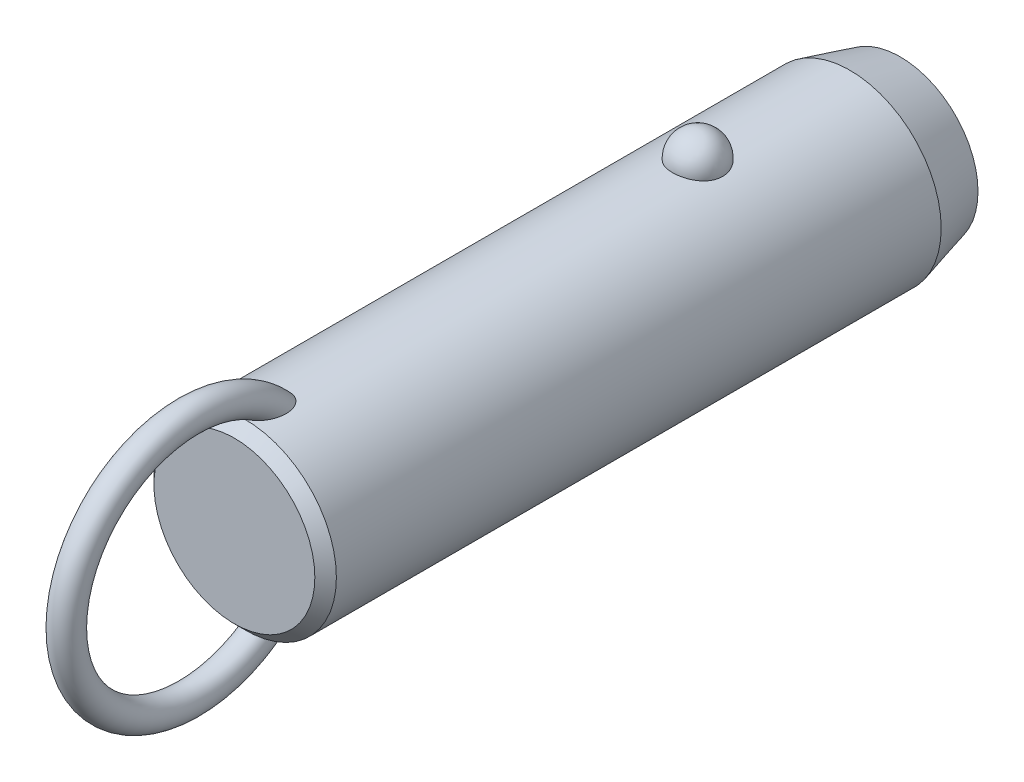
ISO-10303-21;
HEADER;
FILE_DESCRIPTION(('STEP AP214'),'2;1');
FILE_NAME('part.step','',(''),(''),'','','');
FILE_SCHEMA(('AUTOMOTIVE_DESIGN { 1 0 10303 214 1 1 1 1 }'));
ENDSEC;
DATA;
#1=APPLICATION_CONTEXT('core data for automotive mechanical design processes');
#2=APPLICATION_PROTOCOL_DEFINITION('international standard','automotive_design',2000,#1);
#3=PRODUCT_CONTEXT('',#1,'mechanical');
#4=PRODUCT('Part','Part','',(#3));
#5=PRODUCT_RELATED_PRODUCT_CATEGORY('part','',(#4));
#6=PRODUCT_DEFINITION_FORMATION('','',#4);
#7=PRODUCT_DEFINITION_CONTEXT('part definition',#1,'design');
#8=PRODUCT_DEFINITION('design','',#6,#7);
#9=PRODUCT_DEFINITION_SHAPE('','',#8);
#10=(LENGTH_UNIT() NAMED_UNIT(*) SI_UNIT(.MILLI.,.METRE.));
#11=(NAMED_UNIT(*) PLANE_ANGLE_UNIT() SI_UNIT($,.RADIAN.));
#12=(NAMED_UNIT(*) SI_UNIT($,.STERADIAN.) SOLID_ANGLE_UNIT());
#13=UNCERTAINTY_MEASURE_WITH_UNIT(LENGTH_MEASURE(1.E-05),#10,'distance_accuracy_value','');
#14=(GEOMETRIC_REPRESENTATION_CONTEXT(3) GLOBAL_UNCERTAINTY_ASSIGNED_CONTEXT((#13)) GLOBAL_UNIT_ASSIGNED_CONTEXT((#10,
#11,#12)) REPRESENTATION_CONTEXT('',''));
#15=CARTESIAN_POINT('',(0.,0.,0.));
#16=DIRECTION('',(0.,0.,1.));
#17=DIRECTION('',(1.,0.,0.));
#18=AXIS2_PLACEMENT_3D('',#15,#16,#17);
#19=CARTESIAN_POINT('',(0.,0.,48.3));
#20=DIRECTION('',(0.,0.,-1.));
#21=DIRECTION('',(-1.,0.,0.));
#22=AXIS2_PLACEMENT_3D('',#19,#20,#21);
#23=CYLINDRICAL_SURFACE('',#22,12.7);
#24=CARTESIAN_POINT('',(3.46661256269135,12.2177165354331,-3.5));
#25=CARTESIAN_POINT('',(3.4666090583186,12.2177194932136,-3.30432790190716));
#26=CARTESIAN_POINT('',(3.45063567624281,12.2222841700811,-3.10861112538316));
#27=CARTESIAN_POINT('',(3.38712451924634,12.2400345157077,-2.72271899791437));
#28=CARTESIAN_POINT('',(3.33957415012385,12.2532236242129,-2.53254588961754));
#29=CARTESIAN_POINT('',(3.2141234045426,12.286724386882,-2.16324948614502));
#30=CARTESIAN_POINT('',(3.13623639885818,12.3070329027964,-1.98412136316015));
#31=CARTESIAN_POINT('',(2.95205930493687,12.3525018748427,-1.64180592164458));
#32=CARTESIAN_POINT('',(2.84577003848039,12.3776621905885,-1.47861814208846));
#33=CARTESIAN_POINT('',(2.60688050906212,12.4301712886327,-1.17190583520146));
#34=CARTESIAN_POINT('',(2.47415697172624,12.4575299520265,-1.02847897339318));
#35=CARTESIAN_POINT('',(2.18615174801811,12.5112810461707,-0.766177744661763));
#36=CARTESIAN_POINT('',(2.03087002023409,12.5376734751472,-0.647303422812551));
#37=CARTESIAN_POINT('',(1.70237334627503,12.5864761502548,-0.437732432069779));
#38=CARTESIAN_POINT('',(1.52920948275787,12.6088972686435,-0.346958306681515));
#39=CARTESIAN_POINT('',(1.16944170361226,12.6473352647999,-0.195750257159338));
#40=CARTESIAN_POINT('',(0.982839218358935,12.663352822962,-0.135313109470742));
#41=CARTESIAN_POINT('',(0.604961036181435,12.6869706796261,-0.0473241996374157));
#42=CARTESIAN_POINT('',(0.413823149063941,12.6947125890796,-0.0192185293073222));
#43=CARTESIAN_POINT('',(0.0293827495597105,12.7014203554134,0.00517254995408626));
#44=CARTESIAN_POINT('',(-0.163919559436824,12.7003870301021,0.00146092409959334));
#45=CARTESIAN_POINT('',(-0.544374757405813,12.689735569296,-0.0373939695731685));
#46=CARTESIAN_POINT('',(-0.731575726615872,12.6802364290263,-0.0721015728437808));
#47=CARTESIAN_POINT('',(-1.09733277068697,12.6538333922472,-0.171364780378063));
#48=CARTESIAN_POINT('',(-1.27588869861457,12.6369293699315,-0.235920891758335));
#49=CARTESIAN_POINT('',(-1.6204698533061,12.5973946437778,-0.393548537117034));
#50=CARTESIAN_POINT('',(-1.78641865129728,12.5747321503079,-0.486778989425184));
#51=CARTESIAN_POINT('',(-2.10030671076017,12.5261316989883,-0.699110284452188));
#52=CARTESIAN_POINT('',(-2.24824419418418,12.5001934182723,-0.818213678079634));
#53=CARTESIAN_POINT('',(-2.52491489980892,12.4472906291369,-1.08157124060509));
#54=CARTESIAN_POINT('',(-2.65324222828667,12.4203160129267,-1.22624992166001));
#55=CARTESIAN_POINT('',(-2.88410007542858,12.3687509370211,-1.53528325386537));
#56=CARTESIAN_POINT('',(-2.98662883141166,12.3441606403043,-1.69963924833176));
#57=CARTESIAN_POINT('',(-3.16432417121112,12.2998199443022,-2.04548497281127));
#58=CARTESIAN_POINT('',(-3.23917525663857,12.2801261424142,-2.22714424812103));
#59=CARTESIAN_POINT('',(-3.35800573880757,12.248167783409,-2.6009138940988));
#60=CARTESIAN_POINT('',(-3.4019860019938,12.2359030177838,-2.79302397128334));
#61=CARTESIAN_POINT('',(-3.45784812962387,12.2202347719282,-3.18140279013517));
#62=CARTESIAN_POINT('',(-3.46986123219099,12.2167950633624,-3.37765118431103));
#63=CARTESIAN_POINT('',(-3.46186273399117,12.2190638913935,-3.76943689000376));
#64=CARTESIAN_POINT('',(-3.44185196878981,12.2247721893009,-3.96497421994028));
#65=CARTESIAN_POINT('',(-3.37048652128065,12.2446381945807,-4.34881728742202));
#66=CARTESIAN_POINT('',(-3.31928253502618,12.2587552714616,-4.53715319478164));
#67=CARTESIAN_POINT('',(-3.18693461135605,12.2938237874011,-4.90231727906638));
#68=CARTESIAN_POINT('',(-3.1057895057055,12.3147754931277,-5.07914500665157));
#69=CARTESIAN_POINT('',(-2.91506431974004,12.3613125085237,-5.41732059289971));
#70=CARTESIAN_POINT('',(-2.80533587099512,12.3869217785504,-5.57858147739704));
#71=CARTESIAN_POINT('',(-2.560414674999,12.4398525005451,-5.88013283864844));
#72=CARTESIAN_POINT('',(-2.42522099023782,12.4671740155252,-6.02042254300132));
#73=CARTESIAN_POINT('',(-2.1323357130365,12.5205965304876,-6.27662798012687));
#74=CARTESIAN_POINT('',(-1.97456596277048,12.5466928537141,-6.3924554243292));
#75=CARTESIAN_POINT('',(-1.64115839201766,12.5946384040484,-6.59583547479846));
#76=CARTESIAN_POINT('',(-1.46552179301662,12.6164879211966,-6.68339001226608));
#77=CARTESIAN_POINT('',(-1.10356050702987,12.6532533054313,-6.82682153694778));
#78=CARTESIAN_POINT('',(-0.917391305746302,12.6682500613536,-6.8830698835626));
#79=CARTESIAN_POINT('',(-0.537836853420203,12.6900288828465,-6.96386887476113));
#80=CARTESIAN_POINT('',(-0.344452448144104,12.6968119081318,-6.9884232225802));
#81=CARTESIAN_POINT('',(0.0402577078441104,12.7013667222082,-7.00496469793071));
#82=CARTESIAN_POINT('',(0.231556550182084,12.6993008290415,-6.99753844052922));
#83=CARTESIAN_POINT('',(0.610105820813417,12.6867505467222,-6.9516636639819));
#84=CARTESIAN_POINT('',(0.797356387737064,12.6762664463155,-6.913216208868));
#85=CARTESIAN_POINT('',(1.16186657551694,12.6480587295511,-6.80658431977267));
#86=CARTESIAN_POINT('',(1.33915951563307,12.6303611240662,-6.73850666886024));
#87=CARTESIAN_POINT('',(1.67968518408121,12.5896027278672,-6.5745087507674));
#88=CARTESIAN_POINT('',(1.84291705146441,12.5665416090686,-6.47858678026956));
#89=CARTESIAN_POINT('',(2.15340192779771,12.5171072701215,-6.25982455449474));
#90=CARTESIAN_POINT('',(2.30037831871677,12.4906895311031,-6.13660186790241));
#91=CARTESIAN_POINT('',(2.5717412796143,12.4376567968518,-5.86739587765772));
#92=CARTESIAN_POINT('',(2.69612388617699,12.4110417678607,-5.72140858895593));
#93=CARTESIAN_POINT('',(2.92107785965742,12.360051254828,-5.40794137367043));
#94=CARTESIAN_POINT('',(3.02121329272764,12.3357209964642,-5.24014110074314));
#95=CARTESIAN_POINT('',(3.19236291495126,12.2925446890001,-4.8896986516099));
#96=CARTESIAN_POINT('',(3.26338839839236,12.2736965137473,-4.70706226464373));
#97=CARTESIAN_POINT('',(3.36788038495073,12.245404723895,-4.35469510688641));
#98=CARTESIAN_POINT('',(3.40484026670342,12.2351018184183,-4.18605935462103));
#99=CARTESIAN_POINT('',(3.45420764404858,12.2212564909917,-3.84496058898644));
#100=CARTESIAN_POINT('',(3.46661565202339,12.2177139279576,-3.67249765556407));
#101=CARTESIAN_POINT('',(3.46661256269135,12.2177165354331,-3.5));
#102=B_SPLINE_CURVE_WITH_KNOTS('',3,(#24,#25,#26,#27,#28,#29,#30,#31,#32,#33,#34,#35,#36,#37,
#38,#39,#40,#41,#42,#43,#44,#45,#46,#47,#48,#49,#50,#51,#52,#53,#54,#55,#56,#57,#58,#59,#60,#61,
#62,#63,#64,#65,#66,#67,#68,#69,#70,#71,#72,#73,#74,#75,#76,#77,#78,#79,#80,#81,#82,#83,#84,#85,
#86,#87,#88,#89,#90,#91,#92,#93,#94,#95,#96,#97,#98,#99,#100,#101),.UNSPECIFIED.,.T.,.F.,(4,2,2,
2,2,2,2,2,2,2,2,2,2,2,2,2,2,2,2,2,2,2,2,2,2,2,2,2,2,2,2,2,2,2,2,2,2,2,4),(0.,0.586396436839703,
1.17302689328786,1.7593990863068,2.34575431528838,2.93491084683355,3.52406845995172,
4.11158733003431,4.69904375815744,5.2762784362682,5.85345931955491,6.42265312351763,
6.99185659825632,7.56427334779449,8.136746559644,8.71981013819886,9.3029135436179,
9.89247258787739,10.4820150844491,11.0691335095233,11.6562366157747,12.2405256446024,
12.8248374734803,13.412244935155,13.9996740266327,14.5891883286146,15.1786623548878,
15.7609861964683,16.3432419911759,16.914863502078,17.4864654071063,18.0560241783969,
18.6256177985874,19.2037609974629,19.7820055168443,20.3699810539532,20.9577282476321,
21.4746855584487,21.9916320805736),.UNSPECIFIED.);
#103=CARTESIAN_POINT('',(3.46661256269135,12.2177165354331,-3.5));
#104=VERTEX_POINT('',#103);
#105=EDGE_CURVE('E41',#104,#104,#102,.T.);
#106=ORIENTED_EDGE('',*,*,#105,.T.);
#107=EDGE_LOOP('',(#106));
#108=FACE_BOUND('',#107,.T.);
#109=CARTESIAN_POINT('',(0.,0.,59.5));
#110=DIRECTION('',(0.,0.,1.));
#111=DIRECTION('',(1.,0.,0.));
#112=AXIS2_PLACEMENT_3D('',#109,#110,#111);
#113=CIRCLE('',#112,12.7);
#114=CARTESIAN_POINT('',(12.7,0.,59.5));
#115=VERTEX_POINT('',#114);
#116=EDGE_CURVE('E10',#115,#115,#113,.F.);
#117=ORIENTED_EDGE('',*,*,#116,.T.);
#118=EDGE_LOOP('',(#117));
#119=FACE_BOUND('',#118,.T.);
#120=CARTESIAN_POINT('',(-0.548122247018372,-12.6881662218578,53.2432187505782));
#121=CARTESIAN_POINT('',(-0.648865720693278,-12.6838128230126,53.277926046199));
#122=CARTESIAN_POINT('',(-0.746398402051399,-12.6783867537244,53.3220428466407));
#123=CARTESIAN_POINT('',(-0.932125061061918,-12.666091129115,53.4267647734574));
#124=CARTESIAN_POINT('',(-1.02030388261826,-12.6592192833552,53.487396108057));
#125=CARTESIAN_POINT('',(-1.18487740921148,-12.6448747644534,53.621847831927));
#126=CARTESIAN_POINT('',(-1.26134296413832,-12.637406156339,53.6955825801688));
#127=CARTESIAN_POINT('',(-1.4023120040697,-12.6225412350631,53.8536045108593));
#128=CARTESIAN_POINT('',(-1.46681470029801,-12.6151449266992,53.9378923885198));
#129=CARTESIAN_POINT('',(-1.60714786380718,-12.5981718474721,54.1496577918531));
#130=CARTESIAN_POINT('',(-1.67725126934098,-12.588900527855,54.2809624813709));
#131=CARTESIAN_POINT('',(-1.79536591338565,-12.5725964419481,54.5532471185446));
#132=CARTESIAN_POINT('',(-1.84333535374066,-12.5655679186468,54.6942447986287));
#133=CARTESIAN_POINT('',(-1.93422576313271,-12.5519624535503,55.0376455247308));
#134=CARTESIAN_POINT('',(-1.96788773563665,-12.5466298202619,55.2425578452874));
#135=CARTESIAN_POINT('',(-1.9941399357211,-12.542463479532,55.5517600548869));
#136=CARTESIAN_POINT('',(-1.99883864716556,-12.5417153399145,55.6552987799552));
#137=CARTESIAN_POINT('',(-2.00078003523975,-12.5414074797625,55.8624512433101));
#138=CARTESIAN_POINT('',(-1.99802449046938,-12.5418474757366,55.9660649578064));
#139=CARTESIAN_POINT('',(-1.98336733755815,-12.5441750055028,56.2103207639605));
#140=CARTESIAN_POINT('',(-1.96851430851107,-12.5465291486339,56.3507804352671));
#141=CARTESIAN_POINT('',(-1.92707089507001,-12.5529612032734,56.6299607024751));
#142=CARTESIAN_POINT('',(-1.90047458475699,-12.5570399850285,56.7686803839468));
#143=CARTESIAN_POINT('',(-1.83619120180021,-12.5666008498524,57.0434113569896));
#144=CARTESIAN_POINT('',(-1.79850828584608,-12.57208240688,57.1794236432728));
#145=CARTESIAN_POINT('',(-1.71223796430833,-12.5841228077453,57.4478421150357));
#146=CARTESIAN_POINT('',(-1.66365679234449,-12.5906810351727,57.5802503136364));
#147=CARTESIAN_POINT('',(-1.57804503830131,-12.6016176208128,57.7854887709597));
#148=CARTESIAN_POINT('',(-1.54477252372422,-12.6057501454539,57.8599149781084));
#149=CARTESIAN_POINT('',(-1.47424480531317,-12.6141930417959,58.0068393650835));
#150=CARTESIAN_POINT('',(-1.43699041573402,-12.6185033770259,58.0793379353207));
#151=CARTESIAN_POINT('',(-1.35825795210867,-12.6272207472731,58.2218926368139));
#152=CARTESIAN_POINT('',(-1.31678520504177,-12.6316276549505,58.2919517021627));
#153=CARTESIAN_POINT('',(-1.22917793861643,-12.6404532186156,58.4290705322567));
#154=CARTESIAN_POINT('',(-1.18304514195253,-12.6448718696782,58.4961313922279));
#155=CARTESIAN_POINT('',(-1.0724641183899,-12.6547893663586,58.6438741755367));
#156=CARTESIAN_POINT('',(-1.00642239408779,-12.6602600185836,58.7233844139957));
#157=CARTESIAN_POINT('',(-0.86444142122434,-12.6707460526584,58.8731698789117));
#158=CARTESIAN_POINT('',(-0.788516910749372,-12.6757620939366,58.9434585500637));
#159=CARTESIAN_POINT('',(-0.652215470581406,-12.6833591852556,59.0486801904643));
#160=CARTESIAN_POINT('',(-0.594982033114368,-12.6861973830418,59.0876241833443));
#161=CARTESIAN_POINT('',(-0.475269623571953,-12.6912445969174,59.1564899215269));
#162=CARTESIAN_POINT('',(-0.412800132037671,-12.6934547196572,59.1864275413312));
#163=CARTESIAN_POINT('',(-0.29574972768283,-12.6966636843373,59.2297565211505));
#164=CARTESIAN_POINT('',(-0.241949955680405,-12.6978134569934,59.2452188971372));
#165=CARTESIAN_POINT('',(-0.132508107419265,-12.6994261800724,59.2668845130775));
#166=CARTESIAN_POINT('',(-0.0768679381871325,-12.6998898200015,59.2730970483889));
#167=CARTESIAN_POINT('',(0.0347696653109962,-12.7000752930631,59.2755838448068));
#168=CARTESIAN_POINT('',(0.0907676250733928,-12.6997954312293,59.2718353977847));
#169=CARTESIAN_POINT('',(0.201283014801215,-12.6985255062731,59.2547883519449));
#170=CARTESIAN_POINT('',(0.255799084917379,-12.6975348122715,59.2414812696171));
#171=CARTESIAN_POINT('',(0.376042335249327,-12.6946091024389,59.2020379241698));
#172=CARTESIAN_POINT('',(0.440950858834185,-12.6924943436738,59.1734492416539));
#173=CARTESIAN_POINT('',(0.565350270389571,-12.6875639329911,59.1063234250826));
#174=CARTESIAN_POINT('',(0.624828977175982,-12.6847467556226,59.0677646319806));
#175=CARTESIAN_POINT('',(0.774116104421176,-12.6767252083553,58.956949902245));
#176=CARTESIAN_POINT('',(0.859449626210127,-12.6711344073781,58.8787605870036));
#177=CARTESIAN_POINT('',(1.01789440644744,-12.6593922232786,58.710943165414));
#178=CARTESIAN_POINT('',(1.09096902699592,-12.653239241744,58.621282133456));
#179=CARTESIAN_POINT('',(1.22268793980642,-12.6411674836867,58.4402658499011));
#180=CARTESIAN_POINT('',(1.28193986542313,-12.6352572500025,58.349345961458));
#181=CARTESIAN_POINT('',(1.39259777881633,-12.6235401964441,58.1627929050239));
#182=CARTESIAN_POINT('',(1.44399707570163,-12.6177334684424,58.0671558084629));
#183=CARTESIAN_POINT('',(1.53972870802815,-12.6064093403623,57.8722738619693));
#184=CARTESIAN_POINT('',(1.58405262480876,-12.6008922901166,57.7730248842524));
#185=CARTESIAN_POINT('',(1.66600705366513,-12.5903187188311,57.5717727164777));
#186=CARTESIAN_POINT('',(1.70363651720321,-12.5852622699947,57.4697690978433));
#187=CARTESIAN_POINT('',(1.77545379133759,-12.5753406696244,57.2543580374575));
#188=CARTESIAN_POINT('',(1.80903453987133,-12.5705328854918,57.140745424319));
#189=CARTESIAN_POINT('',(1.86844163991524,-12.5618400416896,56.9114575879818));
#190=CARTESIAN_POINT('',(1.89426665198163,-12.5579551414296,56.7957820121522));
#191=CARTESIAN_POINT('',(1.9378546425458,-12.5513030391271,56.5630072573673));
#192=CARTESIAN_POINT('',(1.9556264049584,-12.5485346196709,56.4459097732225));
#193=CARTESIAN_POINT('',(1.98264463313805,-12.5442934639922,56.2107473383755));
#194=CARTESIAN_POINT('',(1.99189298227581,-12.5428204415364,56.0926826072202));
#195=CARTESIAN_POINT('',(2.00416068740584,-12.540871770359,55.7806225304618));
#196=CARTESIAN_POINT('',(1.99944433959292,-12.541631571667,55.5862290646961));
#197=CARTESIAN_POINT('',(1.96113755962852,-12.5476846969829,55.2003095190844));
#198=CARTESIAN_POINT('',(1.92758341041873,-12.5529723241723,55.0087801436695));
#199=CARTESIAN_POINT('',(1.8393434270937,-12.5661532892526,54.6822728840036));
#200=CARTESIAN_POINT('',(1.79215440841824,-12.5730485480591,54.5452499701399));
#201=CARTESIAN_POINT('',(1.67676242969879,-12.588958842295,54.2804459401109));
#202=CARTESIAN_POINT('',(1.60859050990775,-12.597970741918,54.1526515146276));
#203=CARTESIAN_POINT('',(1.46583832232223,-12.6152829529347,53.9358006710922));
#204=CARTESIAN_POINT('',(1.39525727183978,-12.6233659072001,53.8441050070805));
#205=CARTESIAN_POINT('',(1.23992594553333,-12.6395676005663,53.6734854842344));
#206=CARTESIAN_POINT('',(1.15517932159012,-12.6476863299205,53.5945583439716));
#207=CARTESIAN_POINT('',(0.971995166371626,-12.6630846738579,53.4526438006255));
#208=CARTESIAN_POINT('',(0.873456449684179,-12.6703572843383,53.3897849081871));
#209=CARTESIAN_POINT('',(0.665847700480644,-12.6829569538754,53.2844870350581));
#210=CARTESIAN_POINT('',(0.556784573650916,-12.688285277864,53.2420347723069));
#211=CARTESIAN_POINT('',(0.347338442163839,-12.6956226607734,53.1844434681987));
#212=CARTESIAN_POINT('',(0.247759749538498,-12.6979816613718,53.1663996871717));
#213=CARTESIAN_POINT('',(0.0470218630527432,-12.7003077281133,53.1486007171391));
#214=CARTESIAN_POINT('',(-0.0541350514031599,-12.7002779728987,53.1488212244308));
#215=CARTESIAN_POINT('',(-0.221414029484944,-12.6982482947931,53.1643639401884));
#216=CARTESIAN_POINT('',(-0.288055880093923,-12.6969033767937,53.1746662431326));
#217=CARTESIAN_POINT('',(-0.419599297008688,-12.6932369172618,53.2031348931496));
#218=CARTESIAN_POINT('',(-0.484501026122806,-12.6909154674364,53.2213005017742));
#219=CARTESIAN_POINT('',(-0.548122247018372,-12.6881662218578,53.2432187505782));
#220=B_SPLINE_CURVE_WITH_KNOTS('',3,(#120,#121,#122,#123,#124,#125,#126,#127,#128,#129,#130,
#131,#132,#133,#134,#135,#136,#137,#138,#139,#140,#141,#142,#143,#144,#145,#146,#147,#148,#149,
#150,#151,#152,#153,#154,#155,#156,#157,#158,#159,#160,#161,#162,#163,#164,#165,#166,#167,#168,
#169,#170,#171,#172,#173,#174,#175,#176,#177,#178,#179,#180,#181,#182,#183,#184,#185,#186,#187,
#188,#189,#190,#191,#192,#193,#194,#195,#196,#197,#198,#199,#200,#201,#202,#203,#204,#205,#206,
#207,#208,#209,#210,#211,#212,#213,#214,#215,#216,#217,#218,#219),.UNSPECIFIED.,.T.,.F.,(4,2,2,
2,2,2,2,2,2,2,2,2,2,2,2,2,2,2,2,2,2,2,2,2,2,2,2,2,2,2,2,2,2,2,2,2,2,2,2,2,2,2,2,2,2,2,2,2,2,4),
(0.,0.319642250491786,0.63979475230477,0.957927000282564,1.27608021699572,1.72100165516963,
2.16675988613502,2.78630021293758,3.09705782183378,3.40774128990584,3.83096358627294,
4.25439969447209,4.67767724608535,5.10071330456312,5.34550297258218,5.59024267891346,
5.83467707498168,6.07902143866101,6.38891080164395,6.69834321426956,6.90560910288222,
7.11250749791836,7.27977315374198,7.44687060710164,7.61434932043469,7.78197685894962,
7.99365544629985,8.20579780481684,8.55147335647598,8.8981642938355,9.22375138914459,
9.54961437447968,9.8758622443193,10.202161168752,10.557587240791,10.9130746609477,
11.2681734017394,11.6231936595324,12.2046601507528,12.7853961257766,13.219164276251,
13.6522938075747,13.9989174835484,14.3454519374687,14.6946768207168,15.0436740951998,
15.3457513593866,15.6474266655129,15.8493051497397,16.0511646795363),.UNSPECIFIED.);
#221=CARTESIAN_POINT('',(-0.548122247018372,-12.6881662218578,53.2432187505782));
#222=VERTEX_POINT('',#221);
#223=EDGE_CURVE('E59',#222,#222,#220,.T.);
#224=ORIENTED_EDGE('',*,*,#223,.T.);
#225=EDGE_LOOP('',(#224));
#226=FACE_BOUND('',#225,.T.);
#227=CARTESIAN_POINT('',(-0.548122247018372,12.6881662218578,53.2432187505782));
#228=CARTESIAN_POINT('',(-0.459436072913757,12.6919968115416,53.212673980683));
#229=CARTESIAN_POINT('',(-0.368189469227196,12.6949996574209,53.1893913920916));
#230=CARTESIAN_POINT('',(-0.183024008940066,12.6990186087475,53.1584062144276));
#231=CARTESIAN_POINT('',(-0.089104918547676,12.7000345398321,53.1507049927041));
#232=CARTESIAN_POINT('',(0.0987147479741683,12.6999636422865,53.1512455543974));
#233=CARTESIAN_POINT('',(0.192615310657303,12.6988761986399,53.1594920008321));
#234=CARTESIAN_POINT('',(0.377658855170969,12.6947211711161,53.1915515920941));
#235=CARTESIAN_POINT('',(0.46880177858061,12.6916535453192,53.2153650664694));
#236=CARTESIAN_POINT('',(0.645809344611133,12.6838788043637,53.2774565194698));
#237=CARTESIAN_POINT('',(0.731679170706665,12.6791733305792,53.315720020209));
#238=CARTESIAN_POINT('',(0.896315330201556,12.6686004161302,53.405120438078));
#239=CARTESIAN_POINT('',(0.975080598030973,12.6627328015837,53.4562592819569));
#240=CARTESIAN_POINT('',(1.12963655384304,12.6499161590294,53.5736782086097));
#241=CARTESIAN_POINT('',(1.20478673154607,12.6429194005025,53.6407929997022));
#242=CARTESIAN_POINT('',(1.34448241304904,12.6288282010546,53.7852250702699));
#243=CARTESIAN_POINT('',(1.40902173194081,12.621733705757,53.8625482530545));
#244=CARTESIAN_POINT('',(1.55208211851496,12.6050877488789,54.0592475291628));
#245=CARTESIAN_POINT('',(1.62510490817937,12.5957546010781,54.1826540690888));
#246=CARTESIAN_POINT('',(1.7501904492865,12.5789823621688,54.4397690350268));
#247=CARTESIAN_POINT('',(1.80221377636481,12.5715468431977,54.573496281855));
#248=CARTESIAN_POINT('',(1.90309965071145,12.5567434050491,54.8983516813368));
#249=CARTESIAN_POINT('',(1.94342317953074,12.5504515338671,55.0921611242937));
#250=CARTESIAN_POINT('',(1.99332997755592,12.5426147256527,55.4837881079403));
#251=CARTESIAN_POINT('',(2.00285305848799,12.5410790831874,55.681612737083));
#252=CARTESIAN_POINT('',(1.99678999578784,12.5420407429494,56.0166427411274));
#253=CARTESIAN_POINT('',(1.98794117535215,12.5434564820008,56.1540428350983));
#254=CARTESIAN_POINT('',(1.95865119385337,12.5480641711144,56.4276394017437));
#255=CARTESIAN_POINT('',(1.93820436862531,12.5512569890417,56.5638352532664));
#256=CARTESIAN_POINT('',(1.88647896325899,12.5591352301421,56.8342493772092));
#257=CARTESIAN_POINT('',(1.85518800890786,12.5638223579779,56.9684652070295));
#258=CARTESIAN_POINT('',(1.78217886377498,12.5743868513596,57.2339362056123));
#259=CARTESIAN_POINT('',(1.74046509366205,12.5802637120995,57.3651926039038));
#260=CARTESIAN_POINT('',(1.66024095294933,12.5910571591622,57.5860855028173));
#261=CARTESIAN_POINT('',(1.62434772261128,12.5957535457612,57.6766904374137));
#262=CARTESIAN_POINT('',(1.54709009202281,12.6054762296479,57.8555125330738));
#263=CARTESIAN_POINT('',(1.50572681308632,12.6105024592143,57.9437301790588));
#264=CARTESIAN_POINT('',(1.41728020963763,12.620748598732,58.1169321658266));
#265=CARTESIAN_POINT('',(1.37021377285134,12.625967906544,58.2019251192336));
#266=CARTESIAN_POINT('',(1.26969620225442,12.6364721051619,58.3680072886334));
#267=CARTESIAN_POINT('',(1.21624929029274,12.6417569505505,58.4490990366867));
#268=CARTESIAN_POINT('',(1.10304413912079,12.6521331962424,58.6047027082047));
#269=CARTESIAN_POINT('',(1.04340936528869,12.657226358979,58.6793033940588));
#270=CARTESIAN_POINT('',(0.915919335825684,12.6670906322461,58.821324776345));
#271=CARTESIAN_POINT('',(0.848064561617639,12.6718617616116,58.8887458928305));
#272=CARTESIAN_POINT('',(0.717035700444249,12.67987711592,59.0006247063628));
#273=CARTESIAN_POINT('',(0.655526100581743,12.6832377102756,59.0469970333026));
#274=CARTESIAN_POINT('',(0.525985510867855,12.6892676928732,59.1296195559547));
#275=CARTESIAN_POINT('',(0.457969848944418,12.6919386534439,59.1658927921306));
#276=CARTESIAN_POINT('',(0.334859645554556,12.695691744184,59.2166572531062));
#277=CARTESIAN_POINT('',(0.281116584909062,12.6970073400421,59.2343733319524));
#278=CARTESIAN_POINT('',(0.171425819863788,12.6989609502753,59.2606429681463));
#279=CARTESIAN_POINT('',(0.115480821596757,12.699599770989,59.2692074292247));
#280=CARTESIAN_POINT('',(0.00272618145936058,12.7001251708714,59.2762531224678));
#281=CARTESIAN_POINT('',(-0.0540859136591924,12.7000089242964,59.2746964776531));
#282=CARTESIAN_POINT('',(-0.166544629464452,12.6990328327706,59.2616005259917));
#283=CARTESIAN_POINT('',(-0.222190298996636,12.6981724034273,59.2500533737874));
#284=CARTESIAN_POINT('',(-0.342018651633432,12.695562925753,59.2149128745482));
#285=CARTESIAN_POINT('',(-0.405606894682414,12.6936676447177,59.1893322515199));
#286=CARTESIAN_POINT('',(-0.527815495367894,12.6891754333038,59.1283111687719));
#287=CARTESIAN_POINT('',(-0.586425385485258,12.6865770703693,59.0928505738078));
#288=CARTESIAN_POINT('',(-0.731842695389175,12.6792129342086,58.9914960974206));
#289=CARTESIAN_POINT('',(-0.814709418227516,12.6740767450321,58.9200395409));
#290=CARTESIAN_POINT('',(-0.969101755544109,12.6632083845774,58.7658900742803));
#291=CARTESIAN_POINT('',(-1.04059564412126,12.6574746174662,58.6831668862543));
#292=CARTESIAN_POINT('',(-1.1698111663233,12.6461638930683,58.5158096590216));
#293=CARTESIAN_POINT('',(-1.22811369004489,12.6405994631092,58.4316166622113));
#294=CARTESIAN_POINT('',(-1.33743405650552,12.6295007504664,58.2585791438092));
#295=CARTESIAN_POINT('',(-1.38844577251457,12.6239664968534,58.1697307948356));
#296=CARTESIAN_POINT('',(-1.48400702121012,12.6130898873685,57.988389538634));
#297=CARTESIAN_POINT('',(-1.52854232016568,12.6077479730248,57.8958891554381));
#298=CARTESIAN_POINT('',(-1.61150113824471,12.5974127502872,57.7081607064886));
#299=CARTESIAN_POINT('',(-1.64992317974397,12.5924195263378,57.6129319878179));
#300=CARTESIAN_POINT('',(-1.73468589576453,12.581070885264,57.3828936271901));
#301=CARTESIAN_POINT('',(-1.77831261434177,12.5749388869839,57.2470661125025));
#302=CARTESIAN_POINT('',(-1.85439734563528,12.5639437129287,56.9722128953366));
#303=CARTESIAN_POINT('',(-1.88684994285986,12.5590811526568,56.8331856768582));
#304=CARTESIAN_POINT('',(-1.9400848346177,12.550968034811,56.5530923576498));
#305=CARTESIAN_POINT('',(-1.96088706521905,12.5477147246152,56.4120301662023));
#306=CARTESIAN_POINT('',(-1.99000539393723,12.5431291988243,56.1286689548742));
#307=CARTESIAN_POINT('',(-1.99832911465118,12.5417958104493,55.9863707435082));
#308=CARTESIAN_POINT('',(-2.00166624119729,12.5412674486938,55.6576271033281));
#309=CARTESIAN_POINT('',(-1.99178843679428,12.5428579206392,55.471088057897));
#310=CARTESIAN_POINT('',(-1.9445518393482,12.5502731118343,55.1016240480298));
#311=CARTESIAN_POINT('',(-1.90724032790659,12.5560905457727,54.9186934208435));
#312=CARTESIAN_POINT('',(-1.81330718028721,12.5699462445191,54.6048488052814));
#313=CARTESIAN_POINT('',(-1.76338820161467,12.5771273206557,54.4719105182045));
#314=CARTESIAN_POINT('',(-1.64305018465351,12.593414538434,54.2156813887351));
#315=CARTESIAN_POINT('',(-1.57265346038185,12.6025185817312,54.092380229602));
#316=CARTESIAN_POINT('',(-1.42634956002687,12.6198178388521,53.8835648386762));
#317=CARTESIAN_POINT('',(-1.35423772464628,12.6278405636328,53.7953846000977));
#318=CARTESIAN_POINT('',(-1.19645664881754,12.6437632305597,53.6321079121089));
#319=CARTESIAN_POINT('',(-1.11080536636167,12.6516633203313,53.5569944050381));
#320=CARTESIAN_POINT('',(-0.947219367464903,12.6648319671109,53.4378114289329));
#321=CARTESIAN_POINT('',(-0.871624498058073,12.670300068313,53.3905414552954));
#322=CARTESIAN_POINT('',(-0.714161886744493,12.6801492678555,53.3077413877));
#323=CARTESIAN_POINT('',(-0.632295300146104,12.684530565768,53.2722091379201));
#324=CARTESIAN_POINT('',(-0.548122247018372,12.6881662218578,53.2432187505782));
#325=B_SPLINE_CURVE_WITH_KNOTS('',3,(#227,#228,#229,#230,#231,#232,#233,#234,#235,#236,#237,
#238,#239,#240,#241,#242,#243,#244,#245,#246,#247,#248,#249,#250,#251,#252,#253,#254,#255,#256,
#257,#258,#259,#260,#261,#262,#263,#264,#265,#266,#267,#268,#269,#270,#271,#272,#273,#274,#275,
#276,#277,#278,#279,#280,#281,#282,#283,#284,#285,#286,#287,#288,#289,#290,#291,#292,#293,#294,
#295,#296,#297,#298,#299,#300,#301,#302,#303,#304,#305,#306,#307,#308,#309,#310,#311,#312,#313,
#314,#315,#316,#317,#318,#319,#320,#321,#322,#323,#324),.UNSPECIFIED.,.T.,.F.,(4,2,2,2,2,2,2,2,
2,2,2,2,2,2,2,2,2,2,2,2,2,2,2,2,2,2,2,2,2,2,2,2,2,2,2,2,2,2,2,2,2,2,2,2,2,2,2,2,4),(0.,
0.281328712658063,0.56268211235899,0.844117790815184,1.12555942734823,1.40671982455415,
1.68792232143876,1.98972294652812,2.2916988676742,2.72039860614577,3.14989948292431,
3.74084916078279,4.3329529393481,4.74554109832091,5.15833092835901,5.57159335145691,
5.98468079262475,6.27722775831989,6.56971484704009,6.86135609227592,7.15280542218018,
7.43927407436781,7.7257259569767,7.9563586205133,8.18646071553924,8.35559393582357,
8.52452541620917,8.69408946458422,8.86378678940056,9.06834348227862,9.27332014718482,
9.60010414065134,9.92778432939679,10.2350252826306,10.5425229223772,10.8506864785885,
11.1589244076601,11.5867893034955,12.0148612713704,12.4421984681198,12.8692745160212,
13.4279365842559,13.9856380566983,14.4107062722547,14.8353130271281,15.1765567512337,
15.5173516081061,15.7844129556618,16.051425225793),.UNSPECIFIED.);
#326=CARTESIAN_POINT('',(-0.548122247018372,12.6881662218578,53.2432187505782));
#327=VERTEX_POINT('',#326);
#328=EDGE_CURVE('E67',#327,#327,#325,.T.);
#329=ORIENTED_EDGE('',*,*,#328,.T.);
#330=EDGE_LOOP('',(#329));
#331=FACE_BOUND('',#330,.T.);
#332=CARTESIAN_POINT('',(0.,0.,-24.7));
#333=DIRECTION('',(0.,0.,-1.));
#334=DIRECTION('',(-1.,0.,0.));
#335=AXIS2_PLACEMENT_3D('',#332,#333,#334);
#336=CIRCLE('',#335,12.7);
#337=CARTESIAN_POINT('',(12.7,0.,-24.7));
#338=VERTEX_POINT('',#337);
#339=EDGE_CURVE('E56',#338,#338,#336,.F.);
#340=ORIENTED_EDGE('',*,*,#339,.T.);
#341=EDGE_LOOP('',(#340));
#342=FACE_BOUND('',#341,.T.);
#343=ADVANCED_FACE('F37',(#108,#119,#226,#331,#342),#23,.T.);
#344=CARTESIAN_POINT('',(0.,0.,-31.7));
#345=DIRECTION('',(0.,0.,-1.));
#346=DIRECTION('',(-1.,0.,0.));
#347=AXIS2_PLACEMENT_3D('',#344,#345,#346);
#348=PLANE('',#347);
#349=CARTESIAN_POINT('',(0.,0.,-31.7));
#350=DIRECTION('',(0.,0.,-1.));
#351=DIRECTION('',(-1.,0.,0.));
#352=AXIS2_PLACEMENT_3D('',#349,#350,#351);
#353=CIRCLE('',#352,10.8243556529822);
#354=CARTESIAN_POINT('',(10.8243556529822,0.,-31.7));
#355=VERTEX_POINT('',#354);
#356=EDGE_CURVE('E66',#355,#355,#353,.T.);
#357=ORIENTED_EDGE('',*,*,#356,.T.);
#358=EDGE_LOOP('',(#357));
#359=FACE_BOUND('',#358,.T.);
#360=ADVANCED_FACE('F85',(#359),#348,.T.);
#361=CARTESIAN_POINT('',(0.,0.,-31.7));
#362=DIRECTION('',(0.,0.,1.));
#363=DIRECTION('',(1.,0.,0.));
#364=AXIS2_PLACEMENT_3D('',#361,#362,#363);
#365=CONICAL_SURFACE('',#364,10.8243556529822,0.261799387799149);
#366=CARTESIAN_POINT('',(12.7,0.,-24.7));
#367=CARTESIAN_POINT('',(12.6804620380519,0.,-24.7729166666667));
#368=CARTESIAN_POINT('',(12.6609240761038,0.,-24.8458333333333));
#369=CARTESIAN_POINT('',(12.6218481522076,0.,-24.9916666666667));
#370=CARTESIAN_POINT('',(12.6023101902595,0.,-25.0645833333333));
#371=CARTESIAN_POINT('',(12.5632342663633,0.,-25.2104166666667));
#372=CARTESIAN_POINT('',(12.5436963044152,0.,-25.2833333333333));
#373=CARTESIAN_POINT('',(12.504620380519,0.,-25.4291666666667));
#374=CARTESIAN_POINT('',(12.4850824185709,0.,-25.5020833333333));
#375=CARTESIAN_POINT('',(12.4460064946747,0.,-25.6479166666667));
#376=CARTESIAN_POINT('',(12.4264685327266,0.,-25.7208333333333));
#377=CARTESIAN_POINT('',(12.3873926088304,0.,-25.8666666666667));
#378=CARTESIAN_POINT('',(12.3678546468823,0.,-25.9395833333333));
#379=CARTESIAN_POINT('',(12.3287787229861,0.,-26.0854166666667));
#380=CARTESIAN_POINT('',(12.309240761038,0.,-26.1583333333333));
#381=CARTESIAN_POINT('',(12.2701648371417,0.,-26.3041666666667));
#382=CARTESIAN_POINT('',(12.2506268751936,0.,-26.3770833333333));
#383=CARTESIAN_POINT('',(12.2115509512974,0.,-26.5229166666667));
#384=CARTESIAN_POINT('',(12.1920129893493,0.,-26.5958333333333));
#385=CARTESIAN_POINT('',(12.1529370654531,0.,-26.7416666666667));
#386=CARTESIAN_POINT('',(12.133399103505,0.,-26.8145833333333));
#387=CARTESIAN_POINT('',(12.0943231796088,0.,-26.9604166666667));
#388=CARTESIAN_POINT('',(12.0747852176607,0.,-27.0333333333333));
#389=CARTESIAN_POINT('',(12.0357092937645,0.,-27.1791666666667));
#390=CARTESIAN_POINT('',(12.0161713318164,0.,-27.2520833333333));
#391=CARTESIAN_POINT('',(11.9770954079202,0.,-27.3979166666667));
#392=CARTESIAN_POINT('',(11.9575574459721,0.,-27.4708333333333));
#393=CARTESIAN_POINT('',(11.9184815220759,0.,-27.6166666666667));
#394=CARTESIAN_POINT('',(11.8989435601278,0.,-27.6895833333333));
#395=CARTESIAN_POINT('',(11.8598676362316,0.,-27.8354166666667));
#396=CARTESIAN_POINT('',(11.8403296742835,0.,-27.9083333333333));
#397=CARTESIAN_POINT('',(11.8012537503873,0.,-28.0541666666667));
#398=CARTESIAN_POINT('',(11.7817157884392,0.,-28.1270833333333));
#399=CARTESIAN_POINT('',(11.742639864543,0.,-28.2729166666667));
#400=CARTESIAN_POINT('',(11.7231019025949,0.,-28.3458333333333));
#401=CARTESIAN_POINT('',(11.6840259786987,0.,-28.4916666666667));
#402=CARTESIAN_POINT('',(11.6644880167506,0.,-28.5645833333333));
#403=CARTESIAN_POINT('',(11.6254120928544,0.,-28.7104166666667));
#404=CARTESIAN_POINT('',(11.6058741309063,0.,-28.7833333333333));
#405=CARTESIAN_POINT('',(11.5667982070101,0.,-28.9291666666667));
#406=CARTESIAN_POINT('',(11.547260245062,0.,-29.0020833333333));
#407=CARTESIAN_POINT('',(11.5081843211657,0.,-29.1479166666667));
#408=CARTESIAN_POINT('',(11.4886463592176,0.,-29.2208333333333));
#409=CARTESIAN_POINT('',(11.4495704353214,0.,-29.3666666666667));
#410=CARTESIAN_POINT('',(11.4300324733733,0.,-29.4395833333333));
#411=CARTESIAN_POINT('',(11.3909565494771,0.,-29.5854166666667));
#412=CARTESIAN_POINT('',(11.371418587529,0.,-29.6583333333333));
#413=CARTESIAN_POINT('',(11.3323426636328,0.,-29.8041666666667));
#414=CARTESIAN_POINT('',(11.3128047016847,0.,-29.8770833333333));
#415=CARTESIAN_POINT('',(11.2737287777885,0.,-30.0229166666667));
#416=CARTESIAN_POINT('',(11.2541908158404,0.,-30.0958333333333));
#417=CARTESIAN_POINT('',(11.2151148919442,0.,-30.2416666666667));
#418=CARTESIAN_POINT('',(11.1955769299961,0.,-30.3145833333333));
#419=CARTESIAN_POINT('',(11.1565010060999,0.,-30.4604166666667));
#420=CARTESIAN_POINT('',(11.1369630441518,0.,-30.5333333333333));
#421=CARTESIAN_POINT('',(11.0978871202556,0.,-30.6791666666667));
#422=CARTESIAN_POINT('',(11.0783491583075,0.,-30.7520833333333));
#423=CARTESIAN_POINT('',(11.0392732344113,0.,-30.8979166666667));
#424=CARTESIAN_POINT('',(11.0197352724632,0.,-30.9708333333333));
#425=CARTESIAN_POINT('',(10.980659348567,0.,-31.1166666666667));
#426=CARTESIAN_POINT('',(10.9611213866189,0.,-31.1895833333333));
#427=CARTESIAN_POINT('',(10.9220454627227,0.,-31.3354166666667));
#428=CARTESIAN_POINT('',(10.9025075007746,0.,-31.4083333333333));
#429=CARTESIAN_POINT('',(10.8634315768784,0.,-31.5541666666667));
#430=CARTESIAN_POINT('',(10.8438936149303,0.,-31.6270833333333));
#431=CARTESIAN_POINT('',(10.8243556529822,0.,-31.7));
#432=B_SPLINE_CURVE_WITH_KNOTS('',3,(#366,#367,#368,#369,#370,#371,#372,#373,#374,#375,#376,
#377,#378,#379,#380,#381,#382,#383,#384,#385,#386,#387,#388,#389,#390,#391,#392,#393,#394,#395,
#396,#397,#398,#399,#400,#401,#402,#403,#404,#405,#406,#407,#408,#409,#410,#411,#412,#413,#414,
#415,#416,#417,#418,#419,#420,#421,#422,#423,#424,#425,#426,#427,#428,#429,#430,#431),
.UNSPECIFIED.,.F.,.F.,(4,2,2,2,2,2,2,2,2,2,2,2,2,2,2,2,2,2,2,2,2,2,2,2,2,2,2,2,2,2,2,2,4),(0.,
0.226466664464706,0.452933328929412,0.679399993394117,0.905866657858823,1.13233332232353,
1.35879998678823,1.58526665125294,1.81173331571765,2.03819998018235,2.26466664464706,
2.49113330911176,2.71759997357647,2.94406663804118,3.17053330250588,3.39699996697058,
3.62346663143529,3.8499332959,4.0763999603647,4.30286662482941,4.52933328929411,
4.75579995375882,4.98226661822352,5.20873328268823,5.43519994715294,5.66166661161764,
5.88813327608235,6.11459994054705,6.34106660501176,6.56753326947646,6.79399993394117,
7.02046659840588,7.24693326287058),.UNSPECIFIED.);
#433=EDGE_CURVE('BSEAM83',#338,#355,#432,.T.);
#434=ORIENTED_EDGE('',*,*,#339,.F.);
#435=ORIENTED_EDGE('',*,*,#356,.F.);
#436=ORIENTED_EDGE('',*,*,#433,.T.);
#437=ORIENTED_EDGE('',*,*,#433,.F.);
#438=EDGE_LOOP('',(#434,#436,#435,#437));
#439=FACE_BOUND('',#438,.T.);
#440=ADVANCED_FACE('F83',(#439),#365,.T.);
#441=CARTESIAN_POINT('',(0.,0.,61.));
#442=DIRECTION('',(0.,0.,1.));
#443=DIRECTION('',(1.,0.,0.));
#444=AXIS2_PLACEMENT_3D('',#441,#442,#443);
#445=PLANE('',#444);
#446=CARTESIAN_POINT('',(0.,0.,61.));
#447=DIRECTION('',(0.,0.,1.));
#448=DIRECTION('',(1.,0.,0.));
#449=AXIS2_PLACEMENT_3D('',#446,#447,#448);
#450=CIRCLE('',#449,11.2000000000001);
#451=CARTESIAN_POINT('',(11.2000000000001,0.,61.));
#452=VERTEX_POINT('',#451);
#453=EDGE_CURVE('E50',#452,#452,#450,.T.);
#454=ORIENTED_EDGE('',*,*,#453,.T.);
#455=EDGE_LOOP('',(#454));
#456=FACE_BOUND('',#455,.T.);
#457=ADVANCED_FACE('F77',(#456),#445,.T.);
#458=CARTESIAN_POINT('',(0.,0.,67.35));
#459=DIRECTION('',(1.,0.,0.));
#460=DIRECTION('',(0.,0.,-1.));
#461=AXIS2_PLACEMENT_3D('',#458,#459,#460);
#462=TOROIDAL_SURFACE('',#461,17.05,2.);
#463=ORIENTED_EDGE('',*,*,#328,.F.);
#464=EDGE_LOOP('',(#463));
#465=FACE_BOUND('',#464,.T.);
#466=ORIENTED_EDGE('',*,*,#223,.F.);
#467=EDGE_LOOP('',(#466));
#468=FACE_BOUND('',#467,.T.);
#469=ADVANCED_FACE('F73',(#465,#468),#462,.T.);
#470=CARTESIAN_POINT('',(0.,0.,61.));
#471=DIRECTION('',(0.,0.,-1.));
#472=DIRECTION('',(-1.,0.,0.));
#473=AXIS2_PLACEMENT_3D('',#470,#471,#472);
#474=CONICAL_SURFACE('',#473,11.2000000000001,0.785398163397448);
#475=ORIENTED_EDGE('',*,*,#116,.F.);
#476=EDGE_LOOP('',(#475));
#477=FACE_BOUND('',#476,.T.);
#478=ORIENTED_EDGE('',*,*,#453,.F.);
#479=EDGE_LOOP('',(#478));
#480=FACE_BOUND('',#479,.T.);
#481=ADVANCED_FACE('F39',(#477,#480),#474,.T.);
#482=CARTESIAN_POINT('',(0.,12.7,-3.5));
#483=DIRECTION('',(0.,1.,0.));
#484=DIRECTION('',(0.,0.,-1.));
#485=AXIS2_PLACEMENT_3D('',#482,#483,#484);
#486=SPHERICAL_SURFACE('',#485,3.5);
#487=ORIENTED_EDGE('',*,*,#105,.F.);
#488=EDGE_LOOP('',(#487));
#489=FACE_BOUND('',#488,.T.);
#490=ADVANCED_FACE('F79',(#489),#486,.T.);
#491=CLOSED_SHELL('',(#343,#360,#440,#457,#469,#481,#490));
#492=MANIFOLD_SOLID_BREP('B2',#491);
#493=ADVANCED_BREP_SHAPE_REPRESENTATION('',(#18,#492),#14);
#494=SHAPE_DEFINITION_REPRESENTATION(#9,#493);
ENDSEC;
END-ISO-10303-21;
